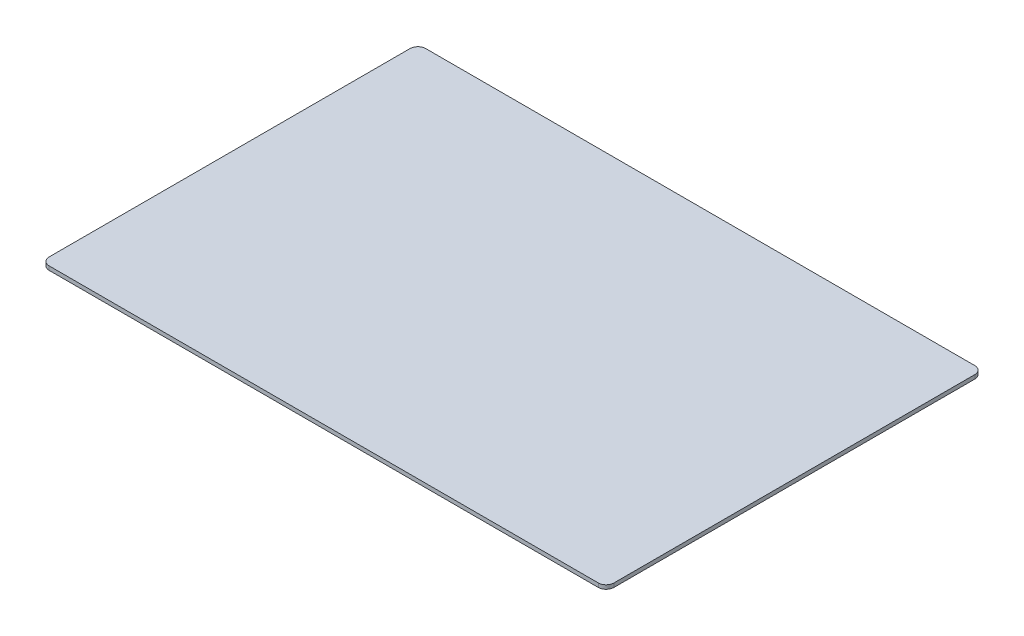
ISO-10303-21;
HEADER;
FILE_DESCRIPTION(('STEP AP214'),'2;1');
FILE_NAME('part.step','',(''),(''),'','','');
FILE_SCHEMA(('AUTOMOTIVE_DESIGN { 1 0 10303 214 1 1 1 1 }'));
ENDSEC;
DATA;
#1=APPLICATION_CONTEXT('core data for automotive mechanical design processes');
#2=APPLICATION_PROTOCOL_DEFINITION('international standard','automotive_design',2000,#1);
#3=PRODUCT_CONTEXT('',#1,'mechanical');
#4=PRODUCT('Part','Part','',(#3));
#5=PRODUCT_RELATED_PRODUCT_CATEGORY('part','',(#4));
#6=PRODUCT_DEFINITION_FORMATION('','',#4);
#7=PRODUCT_DEFINITION_CONTEXT('part definition',#1,'design');
#8=PRODUCT_DEFINITION('design','',#6,#7);
#9=PRODUCT_DEFINITION_SHAPE('','',#8);
#10=(LENGTH_UNIT() NAMED_UNIT(*) SI_UNIT(.MILLI.,.METRE.));
#11=(NAMED_UNIT(*) PLANE_ANGLE_UNIT() SI_UNIT($,.RADIAN.));
#12=(NAMED_UNIT(*) SI_UNIT($,.STERADIAN.) SOLID_ANGLE_UNIT());
#13=UNCERTAINTY_MEASURE_WITH_UNIT(LENGTH_MEASURE(1.E-05),#10,'distance_accuracy_value','');
#14=(GEOMETRIC_REPRESENTATION_CONTEXT(3) GLOBAL_UNCERTAINTY_ASSIGNED_CONTEXT((#13)) GLOBAL_UNIT_ASSIGNED_CONTEXT((#10,
#11,#12)) REPRESENTATION_CONTEXT('',''));
#15=CARTESIAN_POINT('',(0.,0.,0.));
#16=DIRECTION('',(0.,0.,1.));
#17=DIRECTION('',(1.,0.,0.));
#18=AXIS2_PLACEMENT_3D('',#15,#16,#17);
#19=CARTESIAN_POINT('',(228.6,3.175,152.4));
#20=DIRECTION('',(-1.,0.,0.));
#21=DIRECTION('',(0.,0.,1.));
#22=AXIS2_PLACEMENT_3D('',#19,#20,#21);
#23=PLANE('',#22);
#24=DIRECTION('',(0.,0.,-1.));
#25=VECTOR('',#24,1.);
#26=CARTESIAN_POINT('',(228.6,0.,152.4));
#27=LINE('',#26,#25);
#28=CARTESIAN_POINT('',(228.6,0.,146.05));
#29=VERTEX_POINT('',#28);
#30=CARTESIAN_POINT('',(228.6,0.,-146.05));
#31=VERTEX_POINT('',#30);
#32=EDGE_CURVE('E140',#29,#31,#27,.T.);
#33=ORIENTED_EDGE('',*,*,#32,.T.);
#34=DIRECTION('',(0.,-1.,0.));
#35=VECTOR('',#34,1.);
#36=CARTESIAN_POINT('',(228.6,3.175,-146.05));
#37=LINE('',#36,#35);
#38=CARTESIAN_POINT('',(228.6,3.175,-146.05));
#39=VERTEX_POINT('',#38);
#40=EDGE_CURVE('E174',#31,#39,#37,.F.);
#41=ORIENTED_EDGE('',*,*,#40,.T.);
#42=DIRECTION('',(0.,0.,-1.));
#43=VECTOR('',#42,1.);
#44=CARTESIAN_POINT('',(228.6,3.175,152.4));
#45=LINE('',#44,#43);
#46=CARTESIAN_POINT('',(228.6,3.175,146.05));
#47=VERTEX_POINT('',#46);
#48=EDGE_CURVE('E138',#47,#39,#45,.T.);
#49=ORIENTED_EDGE('',*,*,#48,.F.);
#50=DIRECTION('',(0.,-1.,0.));
#51=VECTOR('',#50,1.);
#52=CARTESIAN_POINT('',(228.6,3.175,146.05));
#53=LINE('',#52,#51);
#54=EDGE_CURVE('E170',#47,#29,#53,.T.);
#55=ORIENTED_EDGE('',*,*,#54,.T.);
#56=EDGE_LOOP('',(#33,#41,#49,#55));
#57=FACE_BOUND('',#56,.T.);
#58=ADVANCED_FACE('F38',(#57),#23,.F.);
#59=CARTESIAN_POINT('',(-228.6,3.175,-152.4));
#60=DIRECTION('',(0.,0.,1.));
#61=DIRECTION('',(1.,0.,0.));
#62=AXIS2_PLACEMENT_3D('',#59,#60,#61);
#63=PLANE('',#62);
#64=DIRECTION('',(-1.,0.,0.));
#65=VECTOR('',#64,1.);
#66=CARTESIAN_POINT('',(-228.6,0.,-152.4));
#67=LINE('',#66,#65);
#68=CARTESIAN_POINT('',(222.25,0.,-152.4));
#69=VERTEX_POINT('',#68);
#70=CARTESIAN_POINT('',(-222.25,0.,-152.4));
#71=VERTEX_POINT('',#70);
#72=EDGE_CURVE('E133',#69,#71,#67,.T.);
#73=ORIENTED_EDGE('',*,*,#72,.T.);
#74=DIRECTION('',(0.,-1.,0.));
#75=VECTOR('',#74,1.);
#76=CARTESIAN_POINT('',(-222.25,3.175,-152.4));
#77=LINE('',#76,#75);
#78=CARTESIAN_POINT('',(-222.25,3.175,-152.4));
#79=VERTEX_POINT('',#78);
#80=EDGE_CURVE('E109',#71,#79,#77,.F.);
#81=ORIENTED_EDGE('',*,*,#80,.T.);
#82=DIRECTION('',(-1.,0.,0.));
#83=VECTOR('',#82,1.);
#84=CARTESIAN_POINT('',(-228.6,3.175,-152.4));
#85=LINE('',#84,#83);
#86=CARTESIAN_POINT('',(222.25,3.175,-152.4));
#87=VERTEX_POINT('',#86);
#88=EDGE_CURVE('E194',#87,#79,#85,.T.);
#89=ORIENTED_EDGE('',*,*,#88,.F.);
#90=DIRECTION('',(0.,-1.,0.));
#91=VECTOR('',#90,1.);
#92=CARTESIAN_POINT('',(222.25,3.175,-152.4));
#93=LINE('',#92,#91);
#94=EDGE_CURVE('E115',#87,#69,#93,.T.);
#95=ORIENTED_EDGE('',*,*,#94,.T.);
#96=EDGE_LOOP('',(#73,#81,#89,#95));
#97=FACE_BOUND('',#96,.T.);
#98=ADVANCED_FACE('F219',(#97),#63,.F.);
#99=CARTESIAN_POINT('',(-228.6,3.175,152.4));
#100=DIRECTION('',(1.,0.,0.));
#101=DIRECTION('',(0.,0.,-1.));
#102=AXIS2_PLACEMENT_3D('',#99,#100,#101);
#103=PLANE('',#102);
#104=DIRECTION('',(0.,0.,1.));
#105=VECTOR('',#104,1.);
#106=CARTESIAN_POINT('',(-228.6,3.175,152.4));
#107=LINE('',#106,#105);
#108=CARTESIAN_POINT('',(-228.6,3.175,-146.05));
#109=VERTEX_POINT('',#108);
#110=CARTESIAN_POINT('',(-228.6,3.175,146.05));
#111=VERTEX_POINT('',#110);
#112=EDGE_CURVE('E124',#109,#111,#107,.T.);
#113=ORIENTED_EDGE('',*,*,#112,.F.);
#114=DIRECTION('',(0.,-1.,0.));
#115=VECTOR('',#114,1.);
#116=CARTESIAN_POINT('',(-228.6,3.175,-146.05));
#117=LINE('',#116,#115);
#118=CARTESIAN_POINT('',(-228.6,0.,-146.05));
#119=VERTEX_POINT('',#118);
#120=EDGE_CURVE('E108',#109,#119,#117,.T.);
#121=ORIENTED_EDGE('',*,*,#120,.T.);
#122=DIRECTION('',(0.,0.,1.));
#123=VECTOR('',#122,1.);
#124=CARTESIAN_POINT('',(-228.6,0.,152.4));
#125=LINE('',#124,#123);
#126=CARTESIAN_POINT('',(-228.6,0.,146.05));
#127=VERTEX_POINT('',#126);
#128=EDGE_CURVE('E122',#119,#127,#125,.T.);
#129=ORIENTED_EDGE('',*,*,#128,.T.);
#130=DIRECTION('',(0.,-1.,0.));
#131=VECTOR('',#130,1.);
#132=CARTESIAN_POINT('',(-228.6,3.175,146.05));
#133=LINE('',#132,#131);
#134=EDGE_CURVE('E127',#127,#111,#133,.F.);
#135=ORIENTED_EDGE('',*,*,#134,.T.);
#136=EDGE_LOOP('',(#113,#121,#129,#135));
#137=FACE_BOUND('',#136,.T.);
#138=ADVANCED_FACE('F121',(#137),#103,.F.);
#139=CARTESIAN_POINT('',(-228.6,3.175,152.4));
#140=DIRECTION('',(0.,0.,-1.));
#141=DIRECTION('',(-1.,0.,0.));
#142=AXIS2_PLACEMENT_3D('',#139,#140,#141);
#143=PLANE('',#142);
#144=DIRECTION('',(1.,0.,0.));
#145=VECTOR('',#144,1.);
#146=CARTESIAN_POINT('',(-228.6,0.,152.4));
#147=LINE('',#146,#145);
#148=CARTESIAN_POINT('',(-222.25,0.,152.4));
#149=VERTEX_POINT('',#148);
#150=CARTESIAN_POINT('',(222.25,0.,152.4));
#151=VERTEX_POINT('',#150);
#152=EDGE_CURVE('E132',#149,#151,#147,.T.);
#153=ORIENTED_EDGE('',*,*,#152,.T.);
#154=DIRECTION('',(0.,-1.,0.));
#155=VECTOR('',#154,1.);
#156=CARTESIAN_POINT('',(222.25,3.175,152.4));
#157=LINE('',#156,#155);
#158=CARTESIAN_POINT('',(222.25,3.175,152.4));
#159=VERTEX_POINT('',#158);
#160=EDGE_CURVE('E11',#151,#159,#157,.F.);
#161=ORIENTED_EDGE('',*,*,#160,.T.);
#162=DIRECTION('',(1.,0.,0.));
#163=VECTOR('',#162,1.);
#164=CARTESIAN_POINT('',(-228.6,3.175,152.4));
#165=LINE('',#164,#163);
#166=CARTESIAN_POINT('',(-222.25,3.175,152.4));
#167=VERTEX_POINT('',#166);
#168=EDGE_CURVE('E145',#167,#159,#165,.T.);
#169=ORIENTED_EDGE('',*,*,#168,.F.);
#170=DIRECTION('',(0.,-1.,0.));
#171=VECTOR('',#170,1.);
#172=CARTESIAN_POINT('',(-222.25,3.175,152.4));
#173=LINE('',#172,#171);
#174=EDGE_CURVE('E47',#167,#149,#173,.T.);
#175=ORIENTED_EDGE('',*,*,#174,.T.);
#176=EDGE_LOOP('',(#153,#161,#169,#175));
#177=FACE_BOUND('',#176,.T.);
#178=ADVANCED_FACE('F180',(#177),#143,.F.);
#179=CARTESIAN_POINT('',(0.,3.175,0.));
#180=DIRECTION('',(0.,-1.,0.));
#181=DIRECTION('',(0.,0.,-1.));
#182=AXIS2_PLACEMENT_3D('',#179,#180,#181);
#183=PLANE('',#182);
#184=ORIENTED_EDGE('',*,*,#88,.T.);
#185=CARTESIAN_POINT('',(-222.25,3.175,-146.05));
#186=DIRECTION('',(0.,-1.,0.));
#187=DIRECTION('',(0.,0.,-1.));
#188=AXIS2_PLACEMENT_3D('',#185,#186,#187);
#189=CIRCLE('',#188,6.35);
#190=EDGE_CURVE('E167',#79,#109,#189,.F.);
#191=ORIENTED_EDGE('',*,*,#190,.T.);
#192=ORIENTED_EDGE('',*,*,#112,.T.);
#193=CARTESIAN_POINT('',(-222.25,3.175,146.05));
#194=DIRECTION('',(0.,-1.,0.));
#195=DIRECTION('',(0.,0.,-1.));
#196=AXIS2_PLACEMENT_3D('',#193,#194,#195);
#197=CIRCLE('',#196,6.35);
#198=EDGE_CURVE('E59',#111,#167,#197,.F.);
#199=ORIENTED_EDGE('',*,*,#198,.T.);
#200=ORIENTED_EDGE('',*,*,#168,.T.);
#201=CARTESIAN_POINT('',(222.25,3.175,146.05));
#202=DIRECTION('',(0.,-1.,0.));
#203=DIRECTION('',(0.,0.,-1.));
#204=AXIS2_PLACEMENT_3D('',#201,#202,#203);
#205=CIRCLE('',#204,6.35);
#206=EDGE_CURVE('E161',#159,#47,#205,.F.);
#207=ORIENTED_EDGE('',*,*,#206,.T.);
#208=ORIENTED_EDGE('',*,*,#48,.T.);
#209=CARTESIAN_POINT('',(222.25,3.175,-146.05));
#210=DIRECTION('',(0.,-1.,0.));
#211=DIRECTION('',(0.,0.,-1.));
#212=AXIS2_PLACEMENT_3D('',#209,#210,#211);
#213=CIRCLE('',#212,6.35);
#214=EDGE_CURVE('E164',#39,#87,#213,.F.);
#215=ORIENTED_EDGE('',*,*,#214,.T.);
#216=EDGE_LOOP('',(#184,#191,#192,#199,#200,#207,#208,#215));
#217=FACE_BOUND('',#216,.T.);
#218=ADVANCED_FACE('F208',(#217),#183,.F.);
#219=CARTESIAN_POINT('',(0.,0.,0.));
#220=DIRECTION('',(0.,-1.,0.));
#221=DIRECTION('',(0.,0.,-1.));
#222=AXIS2_PLACEMENT_3D('',#219,#220,#221);
#223=PLANE('',#222);
#224=ORIENTED_EDGE('',*,*,#128,.F.);
#225=CARTESIAN_POINT('',(-222.25,0.,-146.05));
#226=DIRECTION('',(0.,-1.,0.));
#227=DIRECTION('',(0.,0.,-1.));
#228=AXIS2_PLACEMENT_3D('',#225,#226,#227);
#229=CIRCLE('',#228,6.35);
#230=EDGE_CURVE('E104',#119,#71,#229,.T.);
#231=ORIENTED_EDGE('',*,*,#230,.T.);
#232=ORIENTED_EDGE('',*,*,#72,.F.);
#233=CARTESIAN_POINT('',(222.25,0.,-146.05));
#234=DIRECTION('',(0.,-1.,0.));
#235=DIRECTION('',(0.,0.,-1.));
#236=AXIS2_PLACEMENT_3D('',#233,#234,#235);
#237=CIRCLE('',#236,6.35);
#238=EDGE_CURVE('E116',#69,#31,#237,.T.);
#239=ORIENTED_EDGE('',*,*,#238,.T.);
#240=ORIENTED_EDGE('',*,*,#32,.F.);
#241=CARTESIAN_POINT('',(222.25,0.,146.05));
#242=DIRECTION('',(0.,-1.,0.));
#243=DIRECTION('',(0.,0.,-1.));
#244=AXIS2_PLACEMENT_3D('',#241,#242,#243);
#245=CIRCLE('',#244,6.35);
#246=EDGE_CURVE('E149',#29,#151,#245,.T.);
#247=ORIENTED_EDGE('',*,*,#246,.T.);
#248=ORIENTED_EDGE('',*,*,#152,.F.);
#249=CARTESIAN_POINT('',(-222.25,0.,146.05));
#250=DIRECTION('',(0.,-1.,0.));
#251=DIRECTION('',(0.,0.,-1.));
#252=AXIS2_PLACEMENT_3D('',#249,#250,#251);
#253=CIRCLE('',#252,6.35);
#254=EDGE_CURVE('E126',#149,#127,#253,.T.);
#255=ORIENTED_EDGE('',*,*,#254,.T.);
#256=EDGE_LOOP('',(#224,#231,#232,#239,#240,#247,#248,#255));
#257=FACE_BOUND('',#256,.T.);
#258=ADVANCED_FACE('F129',(#257),#223,.T.);
#259=CARTESIAN_POINT('',(-222.25,3.175,-146.05));
#260=DIRECTION('',(0.,-1.,0.));
#261=DIRECTION('',(0.,0.,-1.));
#262=AXIS2_PLACEMENT_3D('',#259,#260,#261);
#263=CYLINDRICAL_SURFACE('',#262,6.35);
#264=ORIENTED_EDGE('',*,*,#190,.F.);
#265=ORIENTED_EDGE('',*,*,#80,.F.);
#266=ORIENTED_EDGE('',*,*,#230,.F.);
#267=ORIENTED_EDGE('',*,*,#120,.F.);
#268=EDGE_LOOP('',(#264,#265,#266,#267));
#269=FACE_BOUND('',#268,.T.);
#270=ADVANCED_FACE('F107',(#269),#263,.T.);
#271=CARTESIAN_POINT('',(222.25,3.175,-146.05));
#272=DIRECTION('',(0.,-1.,0.));
#273=DIRECTION('',(0.,0.,-1.));
#274=AXIS2_PLACEMENT_3D('',#271,#272,#273);
#275=CYLINDRICAL_SURFACE('',#274,6.35);
#276=ORIENTED_EDGE('',*,*,#214,.F.);
#277=ORIENTED_EDGE('',*,*,#40,.F.);
#278=ORIENTED_EDGE('',*,*,#238,.F.);
#279=ORIENTED_EDGE('',*,*,#94,.F.);
#280=EDGE_LOOP('',(#276,#277,#278,#279));
#281=FACE_BOUND('',#280,.T.);
#282=ADVANCED_FACE('F230',(#281),#275,.T.);
#283=CARTESIAN_POINT('',(222.25,3.175,146.05));
#284=DIRECTION('',(0.,-1.,0.));
#285=DIRECTION('',(0.,0.,-1.));
#286=AXIS2_PLACEMENT_3D('',#283,#284,#285);
#287=CYLINDRICAL_SURFACE('',#286,6.35);
#288=ORIENTED_EDGE('',*,*,#206,.F.);
#289=ORIENTED_EDGE('',*,*,#160,.F.);
#290=ORIENTED_EDGE('',*,*,#246,.F.);
#291=ORIENTED_EDGE('',*,*,#54,.F.);
#292=EDGE_LOOP('',(#288,#289,#290,#291));
#293=FACE_BOUND('',#292,.T.);
#294=ADVANCED_FACE('F187',(#293),#287,.T.);
#295=CARTESIAN_POINT('',(-222.25,3.175,146.05));
#296=DIRECTION('',(0.,-1.,0.));
#297=DIRECTION('',(0.,0.,-1.));
#298=AXIS2_PLACEMENT_3D('',#295,#296,#297);
#299=CYLINDRICAL_SURFACE('',#298,6.35);
#300=ORIENTED_EDGE('',*,*,#198,.F.);
#301=ORIENTED_EDGE('',*,*,#134,.F.);
#302=ORIENTED_EDGE('',*,*,#254,.F.);
#303=ORIENTED_EDGE('',*,*,#174,.F.);
#304=EDGE_LOOP('',(#300,#301,#302,#303));
#305=FACE_BOUND('',#304,.T.);
#306=ADVANCED_FACE('F40',(#305),#299,.T.);
#307=CLOSED_SHELL('',(#58,#98,#138,#178,#218,#258,#270,#282,#294,#306));
#308=MANIFOLD_SOLID_BREP('B2',#307);
#309=ADVANCED_BREP_SHAPE_REPRESENTATION('',(#18,#308),#14);
#310=SHAPE_DEFINITION_REPRESENTATION(#9,#309);
ENDSEC;
END-ISO-10303-21;
